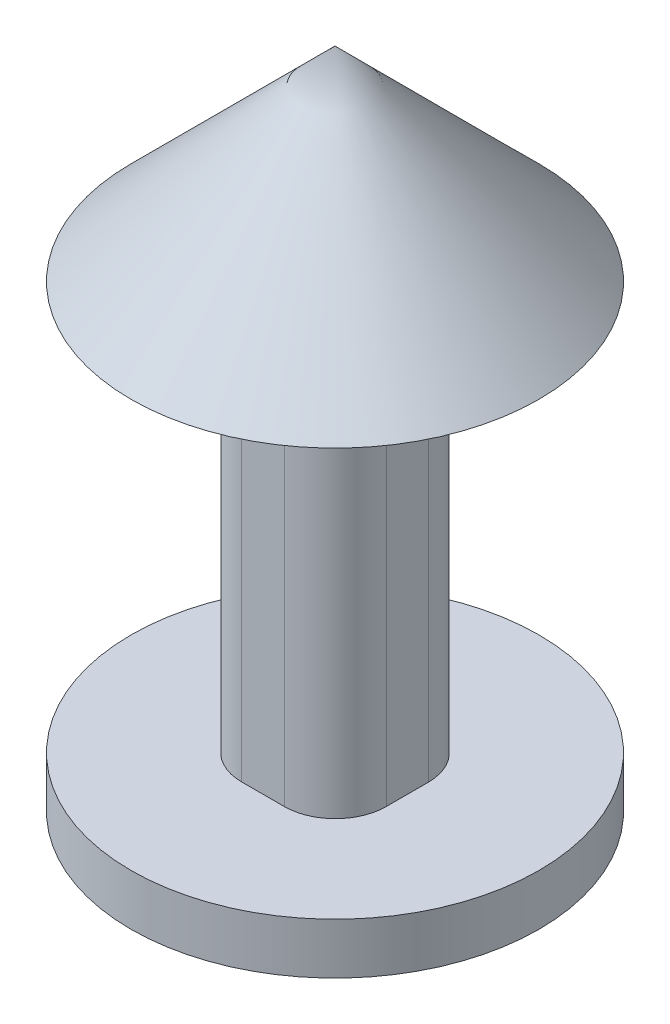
from build123d import *

# Parameters (mm, degrees)
SKETCH1_R           = 101.6
BOSS_EXTRUDE1_DEPTH = 25.4
BOSS_EXTRUDE2_DEPTH = 203.2


with BuildPart() as part:
    # Sketch1 → Boss-Extrude1 (new body)
    with BuildSketch(Plane(origin=(0, 0, 0), x_dir=(1, 0, 0), z_dir=(0, 1, 0))):
        with Locations(Location((0, 0, 0), (0, 0, 270))):
            Circle(SKETCH1_R)
    extrude(amount=BOSS_EXTRUDE1_DEPTH)

    # Sketch2 → Boss-Extrude2 (add)
    with BuildSketch(Plane(origin=(0, 25.4, 0), x_dir=(1, 0, 0), z_dir=(0, 1, 0))):
        with BuildLine():
            Line((-10.590169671, -35.851745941), (10.590169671, -35.851745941))
            ThreePointArc((10.590169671, -35.851745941), (28.550681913, -28.412258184), (35.990169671, -10.451745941))
            Line((35.990169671, -10.451745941), (35.990169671, 10.451745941))
            ThreePointArc((35.990169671, 10.451745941), (28.550681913, 28.412258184), (10.590169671, 35.851745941))
            Line((10.590169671, 35.851745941), (-10.590169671, 35.851745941))
            ThreePointArc((-10.590169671, 35.851745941), (-28.550681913, 28.412258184), (-35.990169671, 10.451745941))
            Line((-35.990169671, 10.451745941), (-35.990169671, -10.451745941))
            ThreePointArc((-35.990169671, -10.451745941), (-28.550681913, -28.412258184), (-10.590169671, -35.851745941))
        make_face()
    extrude(amount=BOSS_EXTRUDE2_DEPTH)

    # Sketch3 → Revolve1 (revolve)
    with BuildSketch(Plane.XY):
        Polygon((0, 228.6), (101.6, 228.6), (0, 330.2), align=None)
    revolve(axis=Axis((0, 228.6, 0), (0, 1, 0)))


solid = part.part
